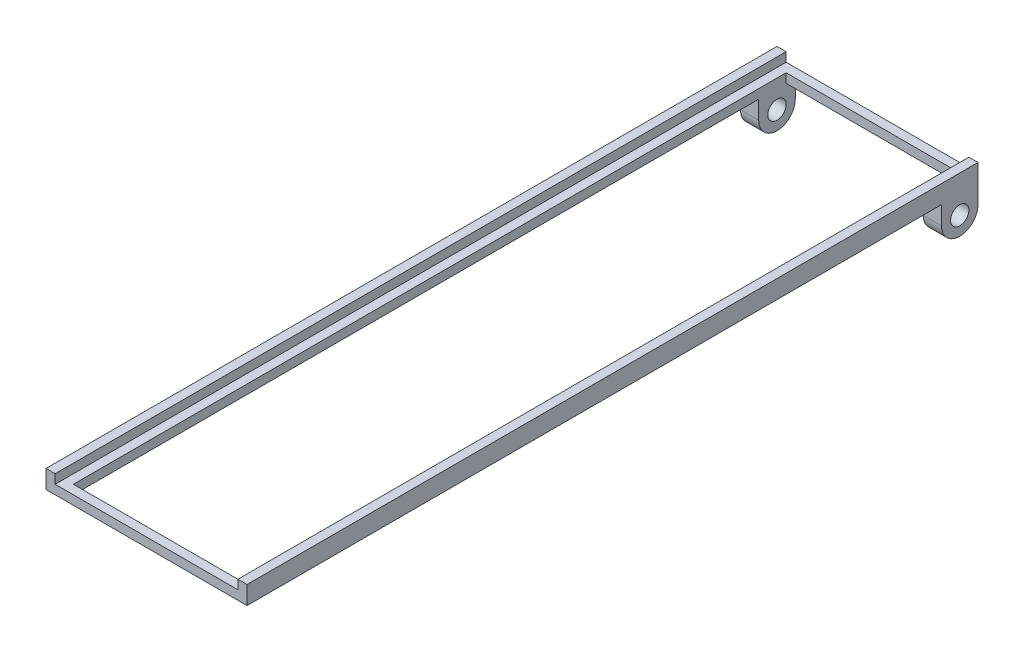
ISO-10303-21;
HEADER;
FILE_DESCRIPTION(('STEP AP214'),'2;1');
FILE_NAME('part.step','',(''),(''),'','','');
FILE_SCHEMA(('AUTOMOTIVE_DESIGN { 1 0 10303 214 1 1 1 1 }'));
ENDSEC;
DATA;
#1=APPLICATION_CONTEXT('core data for automotive mechanical design processes');
#2=APPLICATION_PROTOCOL_DEFINITION('international standard','automotive_design',2000,#1);
#3=PRODUCT_CONTEXT('',#1,'mechanical');
#4=PRODUCT('Part','Part','',(#3));
#5=PRODUCT_RELATED_PRODUCT_CATEGORY('part','',(#4));
#6=PRODUCT_DEFINITION_FORMATION('','',#4);
#7=PRODUCT_DEFINITION_CONTEXT('part definition',#1,'design');
#8=PRODUCT_DEFINITION('design','',#6,#7);
#9=PRODUCT_DEFINITION_SHAPE('','',#8);
#10=(LENGTH_UNIT() NAMED_UNIT(*) SI_UNIT(.MILLI.,.METRE.));
#11=(NAMED_UNIT(*) PLANE_ANGLE_UNIT() SI_UNIT($,.RADIAN.));
#12=(NAMED_UNIT(*) SI_UNIT($,.STERADIAN.) SOLID_ANGLE_UNIT());
#13=UNCERTAINTY_MEASURE_WITH_UNIT(LENGTH_MEASURE(1.E-05),#10,'distance_accuracy_value','');
#14=(GEOMETRIC_REPRESENTATION_CONTEXT(3) GLOBAL_UNCERTAINTY_ASSIGNED_CONTEXT((#13)) GLOBAL_UNIT_ASSIGNED_CONTEXT((#10,
#11,#12)) REPRESENTATION_CONTEXT('',''));
#15=CARTESIAN_POINT('',(0.,0.,0.));
#16=DIRECTION('',(0.,0.,1.));
#17=DIRECTION('',(1.,0.,0.));
#18=AXIS2_PLACEMENT_3D('',#15,#16,#17);
#19=CARTESIAN_POINT('',(110.,0.,800.));
#20=DIRECTION('',(0.,1.,0.));
#21=DIRECTION('',(-1.,0.,0.));
#22=AXIS2_PLACEMENT_3D('',#19,#20,#21);
#23=PLANE('',#22);
#24=DIRECTION('',(0.,0.,-1.));
#25=VECTOR('',#24,1.);
#26=CARTESIAN_POINT('',(90.,-1.2490009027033E-13,40.));
#27=LINE('',#26,#25);
#28=CARTESIAN_POINT('',(90.,-1.2490009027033E-13,10.));
#29=VERTEX_POINT('',#28);
#30=CARTESIAN_POINT('',(90.,0.,0.));
#31=VERTEX_POINT('',#30);
#32=EDGE_CURVE('E488',#29,#31,#27,.T.);
#33=ORIENTED_EDGE('',*,*,#32,.F.);
#34=DIRECTION('',(-1.,0.,0.));
#35=VECTOR('',#34,1.);
#36=CARTESIAN_POINT('',(90.,0.,9.99999999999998));
#37=LINE('',#36,#35);
#38=CARTESIAN_POINT('',(-90.,-1.2490009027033E-13,9.99999999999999));
#39=VERTEX_POINT('',#38);
#40=EDGE_CURVE('E547',#29,#39,#37,.T.);
#41=ORIENTED_EDGE('',*,*,#40,.T.);
#42=DIRECTION('',(0.,0.,-1.));
#43=VECTOR('',#42,1.);
#44=CARTESIAN_POINT('',(-90.,-1.2490009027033E-13,40.));
#45=LINE('',#44,#43);
#46=CARTESIAN_POINT('',(-90.,0.,0.));
#47=VERTEX_POINT('',#46);
#48=EDGE_CURVE('E11',#39,#47,#45,.T.);
#49=ORIENTED_EDGE('',*,*,#48,.T.);
#50=DIRECTION('',(1.,0.,0.));
#51=VECTOR('',#50,1.);
#52=CARTESIAN_POINT('',(110.,0.,0.));
#53=LINE('',#52,#51);
#54=EDGE_CURVE('E372',#47,#31,#53,.T.);
#55=ORIENTED_EDGE('',*,*,#54,.T.);
#56=EDGE_LOOP('',(#33,#41,#49,#55));
#57=FACE_BOUND('',#56,.T.);
#58=ADVANCED_FACE('F348',(#57),#23,.F.);
#59=DIRECTION('',(1.,0.,0.));
#60=VECTOR('',#59,1.);
#61=CARTESIAN_POINT('',(90.,-1.2490009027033E-13,40.));
#62=LINE('',#61,#60);
#63=CARTESIAN_POINT('',(90.,0.,40.));
#64=VERTEX_POINT('',#63);
#65=CARTESIAN_POINT('',(110.,0.,40.));
#66=VERTEX_POINT('',#65);
#67=EDGE_CURVE('E365',#64,#66,#62,.T.);
#68=ORIENTED_EDGE('',*,*,#67,.T.);
#69=DIRECTION('',(0.,0.,-1.));
#70=VECTOR('',#69,1.);
#71=CARTESIAN_POINT('',(110.,0.,800.));
#72=LINE('',#71,#70);
#73=CARTESIAN_POINT('',(110.,0.,800.));
#74=VERTEX_POINT('',#73);
#75=EDGE_CURVE('E500',#74,#66,#72,.T.);
#76=ORIENTED_EDGE('',*,*,#75,.F.);
#77=DIRECTION('',(1.,0.,0.));
#78=VECTOR('',#77,1.);
#79=CARTESIAN_POINT('',(-110.,0.,800.));
#80=LINE('',#79,#78);
#81=CARTESIAN_POINT('',(-110.,0.,800.));
#82=VERTEX_POINT('',#81);
#83=EDGE_CURVE('E603',#82,#74,#80,.T.);
#84=ORIENTED_EDGE('',*,*,#83,.F.);
#85=DIRECTION('',(0.,0.,-1.));
#86=VECTOR('',#85,1.);
#87=CARTESIAN_POINT('',(-110.,0.,800.));
#88=LINE('',#87,#86);
#89=CARTESIAN_POINT('',(-110.,-1.52655665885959E-13,40.));
#90=VERTEX_POINT('',#89);
#91=EDGE_CURVE('E532',#82,#90,#88,.T.);
#92=ORIENTED_EDGE('',*,*,#91,.T.);
#93=DIRECTION('',(-1.,0.,0.));
#94=VECTOR('',#93,1.);
#95=CARTESIAN_POINT('',(-90.,-1.2490009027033E-13,40.));
#96=LINE('',#95,#94);
#97=CARTESIAN_POINT('',(-90.,-1.2490009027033E-13,40.));
#98=VERTEX_POINT('',#97);
#99=EDGE_CURVE('E554',#98,#90,#96,.T.);
#100=ORIENTED_EDGE('',*,*,#99,.F.);
#101=DIRECTION('',(0.,0.,1.));
#102=VECTOR('',#101,1.);
#103=CARTESIAN_POINT('',(-90.,0.,790.));
#104=LINE('',#103,#102);
#105=CARTESIAN_POINT('',(-90.,0.,790.));
#106=VERTEX_POINT('',#105);
#107=EDGE_CURVE('E550',#98,#106,#104,.T.);
#108=ORIENTED_EDGE('',*,*,#107,.T.);
#109=DIRECTION('',(1.,0.,0.));
#110=VECTOR('',#109,1.);
#111=CARTESIAN_POINT('',(90.0000000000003,0.,790.));
#112=LINE('',#111,#110);
#113=CARTESIAN_POINT('',(90.0000000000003,0.,790.));
#114=VERTEX_POINT('',#113);
#115=EDGE_CURVE('E577',#106,#114,#112,.T.);
#116=ORIENTED_EDGE('',*,*,#115,.T.);
#117=DIRECTION('',(0.,0.,-1.));
#118=VECTOR('',#117,1.);
#119=CARTESIAN_POINT('',(90.0000000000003,0.,790.));
#120=LINE('',#119,#118);
#121=EDGE_CURVE('E544',#114,#64,#120,.T.);
#122=ORIENTED_EDGE('',*,*,#121,.T.);
#123=EDGE_LOOP('',(#68,#76,#84,#92,#100,#108,#116,#122));
#124=FACE_BOUND('',#123,.T.);
#125=ADVANCED_FACE('F675',(#124),#23,.F.);
#126=CARTESIAN_POINT('',(100.,10.,800.));
#127=DIRECTION('',(1.,0.,0.));
#128=DIRECTION('',(0.,0.,-1.));
#129=AXIS2_PLACEMENT_3D('',#126,#127,#128);
#130=PLANE('',#129);
#131=DIRECTION('',(0.,-1.,0.));
#132=VECTOR('',#131,1.);
#133=CARTESIAN_POINT('',(100.,10.,0.));
#134=LINE('',#133,#132);
#135=CARTESIAN_POINT('',(100.,20.,0.));
#136=VERTEX_POINT('',#135);
#137=CARTESIAN_POINT('',(100.,10.,0.));
#138=VERTEX_POINT('',#137);
#139=EDGE_CURVE('E637',#136,#138,#134,.T.);
#140=ORIENTED_EDGE('',*,*,#139,.T.);
#141=DIRECTION('',(0.,0.,-1.));
#142=VECTOR('',#141,1.);
#143=CARTESIAN_POINT('',(100.,10.,800.));
#144=LINE('',#143,#142);
#145=CARTESIAN_POINT('',(100.,10.,800.));
#146=VERTEX_POINT('',#145);
#147=EDGE_CURVE('E357',#146,#138,#144,.T.);
#148=ORIENTED_EDGE('',*,*,#147,.F.);
#149=DIRECTION('',(0.,-1.,0.));
#150=VECTOR('',#149,1.);
#151=CARTESIAN_POINT('',(100.,10.,800.));
#152=LINE('',#151,#150);
#153=CARTESIAN_POINT('',(100.,20.,800.));
#154=VERTEX_POINT('',#153);
#155=EDGE_CURVE('E592',#154,#146,#152,.T.);
#156=ORIENTED_EDGE('',*,*,#155,.F.);
#157=DIRECTION('',(0.,0.,-1.));
#158=VECTOR('',#157,1.);
#159=CARTESIAN_POINT('',(100.,20.,800.));
#160=LINE('',#159,#158);
#161=EDGE_CURVE('E609',#154,#136,#160,.T.);
#162=ORIENTED_EDGE('',*,*,#161,.T.);
#163=EDGE_LOOP('',(#140,#148,#156,#162));
#164=FACE_BOUND('',#163,.T.);
#165=ADVANCED_FACE('F350',(#164),#130,.F.);
#166=CARTESIAN_POINT('',(50.,10.,800.));
#167=DIRECTION('',(0.,-1.,0.));
#168=DIRECTION('',(1.,0.,0.));
#169=AXIS2_PLACEMENT_3D('',#166,#167,#168);
#170=PLANE('',#169);
#171=DIRECTION('',(0.,0.,1.));
#172=VECTOR('',#171,1.);
#173=CARTESIAN_POINT('',(-90.,10.,790.));
#174=LINE('',#173,#172);
#175=CARTESIAN_POINT('',(-90.,9.99999999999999,10.));
#176=VERTEX_POINT('',#175);
#177=CARTESIAN_POINT('',(-90.,10.,790.));
#178=VERTEX_POINT('',#177);
#179=EDGE_CURVE('E567',#176,#178,#174,.T.);
#180=ORIENTED_EDGE('',*,*,#179,.F.);
#181=DIRECTION('',(-1.,0.,0.));
#182=VECTOR('',#181,1.);
#183=CARTESIAN_POINT('',(90.,10.,9.99999999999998));
#184=LINE('',#183,#182);
#185=CARTESIAN_POINT('',(90.,10.,9.99999999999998));
#186=VERTEX_POINT('',#185);
#187=EDGE_CURVE('E556',#186,#176,#184,.T.);
#188=ORIENTED_EDGE('',*,*,#187,.F.);
#189=DIRECTION('',(0.,0.,-1.));
#190=VECTOR('',#189,1.);
#191=CARTESIAN_POINT('',(90.0000000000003,10.,790.));
#192=LINE('',#191,#190);
#193=CARTESIAN_POINT('',(90.0000000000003,10.,790.));
#194=VERTEX_POINT('',#193);
#195=EDGE_CURVE('E551',#194,#186,#192,.T.);
#196=ORIENTED_EDGE('',*,*,#195,.F.);
#197=DIRECTION('',(1.,0.,0.));
#198=VECTOR('',#197,1.);
#199=CARTESIAN_POINT('',(90.0000000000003,10.,790.));
#200=LINE('',#199,#198);
#201=EDGE_CURVE('E570',#178,#194,#200,.T.);
#202=ORIENTED_EDGE('',*,*,#201,.F.);
#203=EDGE_LOOP('',(#180,#188,#196,#202));
#204=FACE_BOUND('',#203,.T.);
#205=DIRECTION('',(-1.,0.,0.));
#206=VECTOR('',#205,1.);
#207=CARTESIAN_POINT('',(50.,10.,0.));
#208=LINE('',#207,#206);
#209=CARTESIAN_POINT('',(-100.,9.99999999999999,0.));
#210=VERTEX_POINT('',#209);
#211=EDGE_CURVE('E633',#138,#210,#208,.T.);
#212=ORIENTED_EDGE('',*,*,#211,.T.);
#213=DIRECTION('',(0.,0.,-1.));
#214=VECTOR('',#213,1.);
#215=CARTESIAN_POINT('',(-100.,9.99999999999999,800.));
#216=LINE('',#215,#214);
#217=CARTESIAN_POINT('',(-100.,9.99999999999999,800.));
#218=VERTEX_POINT('',#217);
#219=EDGE_CURVE('E622',#218,#210,#216,.T.);
#220=ORIENTED_EDGE('',*,*,#219,.F.);
#221=DIRECTION('',(-1.,0.,0.));
#222=VECTOR('',#221,1.);
#223=CARTESIAN_POINT('',(50.,10.,800.));
#224=LINE('',#223,#222);
#225=EDGE_CURVE('E595',#146,#218,#224,.T.);
#226=ORIENTED_EDGE('',*,*,#225,.F.);
#227=ORIENTED_EDGE('',*,*,#147,.T.);
#228=EDGE_LOOP('',(#212,#220,#226,#227));
#229=FACE_BOUND('',#228,.T.);
#230=ADVANCED_FACE('F632',(#204,#229),#170,.F.);
#231=CARTESIAN_POINT('',(-100.,9.99999999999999,800.));
#232=DIRECTION('',(-1.,0.,0.));
#233=DIRECTION('',(0.,-1.,0.));
#234=AXIS2_PLACEMENT_3D('',#231,#232,#233);
#235=PLANE('',#234);
#236=DIRECTION('',(0.,1.,0.));
#237=VECTOR('',#236,1.);
#238=CARTESIAN_POINT('',(-100.,9.99999999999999,0.));
#239=LINE('',#238,#237);
#240=CARTESIAN_POINT('',(-100.,20.,0.));
#241=VERTEX_POINT('',#240);
#242=EDGE_CURVE('E643',#210,#241,#239,.T.);
#243=ORIENTED_EDGE('',*,*,#242,.T.);
#244=DIRECTION('',(0.,0.,-1.));
#245=VECTOR('',#244,1.);
#246=CARTESIAN_POINT('',(-100.,20.,800.));
#247=LINE('',#246,#245);
#248=CARTESIAN_POINT('',(-100.,20.,800.));
#249=VERTEX_POINT('',#248);
#250=EDGE_CURVE('E620',#249,#241,#247,.T.);
#251=ORIENTED_EDGE('',*,*,#250,.F.);
#252=DIRECTION('',(0.,1.,0.));
#253=VECTOR('',#252,1.);
#254=CARTESIAN_POINT('',(-100.,9.99999999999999,800.));
#255=LINE('',#254,#253);
#256=EDGE_CURVE('E597',#218,#249,#255,.T.);
#257=ORIENTED_EDGE('',*,*,#256,.F.);
#258=ORIENTED_EDGE('',*,*,#219,.T.);
#259=EDGE_LOOP('',(#243,#251,#257,#258));
#260=FACE_BOUND('',#259,.T.);
#261=ADVANCED_FACE('F684',(#260),#235,.F.);
#262=CARTESIAN_POINT('',(-100.,20.,800.));
#263=DIRECTION('',(0.,-1.,0.));
#264=DIRECTION('',(1.,0.,0.));
#265=AXIS2_PLACEMENT_3D('',#262,#263,#264);
#266=PLANE('',#265);
#267=DIRECTION('',(-1.,0.,0.));
#268=VECTOR('',#267,1.);
#269=CARTESIAN_POINT('',(-100.,20.,0.));
#270=LINE('',#269,#268);
#271=CARTESIAN_POINT('',(-110.,20.,0.));
#272=VERTEX_POINT('',#271);
#273=EDGE_CURVE('E650',#241,#272,#270,.T.);
#274=ORIENTED_EDGE('',*,*,#273,.T.);
#275=DIRECTION('',(0.,0.,-1.));
#276=VECTOR('',#275,1.);
#277=CARTESIAN_POINT('',(-110.,20.,800.));
#278=LINE('',#277,#276);
#279=CARTESIAN_POINT('',(-110.,20.,800.));
#280=VERTEX_POINT('',#279);
#281=EDGE_CURVE('E617',#280,#272,#278,.T.);
#282=ORIENTED_EDGE('',*,*,#281,.F.);
#283=DIRECTION('',(-1.,0.,0.));
#284=VECTOR('',#283,1.);
#285=CARTESIAN_POINT('',(-100.,20.,800.));
#286=LINE('',#285,#284);
#287=EDGE_CURVE('E599',#249,#280,#286,.T.);
#288=ORIENTED_EDGE('',*,*,#287,.F.);
#289=ORIENTED_EDGE('',*,*,#250,.T.);
#290=EDGE_LOOP('',(#274,#282,#288,#289));
#291=FACE_BOUND('',#290,.T.);
#292=ADVANCED_FACE('F682',(#291),#266,.F.);
#293=CARTESIAN_POINT('',(-110.,20.,800.));
#294=DIRECTION('',(1.,0.,0.));
#295=DIRECTION('',(0.,1.,0.));
#296=AXIS2_PLACEMENT_3D('',#293,#294,#295);
#297=PLANE('',#296);
#298=DIRECTION('',(0.,-1.,0.));
#299=VECTOR('',#298,1.);
#300=CARTESIAN_POINT('',(-110.,20.,0.));
#301=LINE('',#300,#299);
#302=CARTESIAN_POINT('',(-110.,-20.0000000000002,0.));
#303=VERTEX_POINT('',#302);
#304=EDGE_CURVE('E584',#272,#303,#301,.T.);
#305=ORIENTED_EDGE('',*,*,#304,.T.);
#306=CARTESIAN_POINT('',(-110.,-20.0000000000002,20.));
#307=DIRECTION('',(-1.,0.,0.));
#308=DIRECTION('',(0.,-1.,0.));
#309=AXIS2_PLACEMENT_3D('',#306,#307,#308);
#310=CIRCLE('',#309,20.);
#311=CARTESIAN_POINT('',(-110.,-20.0000000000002,40.));
#312=VERTEX_POINT('',#311);
#313=EDGE_CURVE('E522',#303,#312,#310,.T.);
#314=ORIENTED_EDGE('',*,*,#313,.T.);
#315=DIRECTION('',(0.,1.,0.));
#316=VECTOR('',#315,1.);
#317=CARTESIAN_POINT('',(-110.,-1.52655665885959E-13,40.));
#318=LINE('',#317,#316);
#319=EDGE_CURVE('E525',#312,#90,#318,.T.);
#320=ORIENTED_EDGE('',*,*,#319,.T.);
#321=ORIENTED_EDGE('',*,*,#91,.F.);
#322=DIRECTION('',(0.,-1.,0.));
#323=VECTOR('',#322,1.);
#324=CARTESIAN_POINT('',(-110.,20.,800.));
#325=LINE('',#324,#323);
#326=EDGE_CURVE('E601',#280,#82,#325,.T.);
#327=ORIENTED_EDGE('',*,*,#326,.F.);
#328=ORIENTED_EDGE('',*,*,#281,.T.);
#329=EDGE_LOOP('',(#305,#314,#320,#321,#327,#328));
#330=FACE_BOUND('',#329,.T.);
#331=CARTESIAN_POINT('',(-110.,-20.0000000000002,20.));
#332=DIRECTION('',(-1.,0.,0.));
#333=DIRECTION('',(0.,-1.,0.));
#334=AXIS2_PLACEMENT_3D('',#331,#332,#333);
#335=CIRCLE('',#334,10.);
#336=CARTESIAN_POINT('',(-110.,-30.0000000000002,20.));
#337=VERTEX_POINT('',#336);
#338=EDGE_CURVE('E514',#337,#337,#335,.T.);
#339=ORIENTED_EDGE('',*,*,#338,.F.);
#340=EDGE_LOOP('',(#339));
#341=FACE_BOUND('',#340,.T.);
#342=ADVANCED_FACE('F656',(#330,#341),#297,.F.);
#343=CARTESIAN_POINT('',(110.,20.,800.));
#344=DIRECTION('',(-1.,0.,0.));
#345=DIRECTION('',(0.,0.,1.));
#346=AXIS2_PLACEMENT_3D('',#343,#344,#345);
#347=PLANE('',#346);
#348=DIRECTION('',(0.,1.,0.));
#349=VECTOR('',#348,1.);
#350=CARTESIAN_POINT('',(110.,20.,0.));
#351=LINE('',#350,#349);
#352=CARTESIAN_POINT('',(110.,-20.0000000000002,0.));
#353=VERTEX_POINT('',#352);
#354=CARTESIAN_POINT('',(110.,20.,0.));
#355=VERTEX_POINT('',#354);
#356=EDGE_CURVE('E583',#353,#355,#351,.T.);
#357=ORIENTED_EDGE('',*,*,#356,.T.);
#358=DIRECTION('',(0.,0.,-1.));
#359=VECTOR('',#358,1.);
#360=CARTESIAN_POINT('',(110.,20.,800.));
#361=LINE('',#360,#359);
#362=CARTESIAN_POINT('',(110.,20.,800.));
#363=VERTEX_POINT('',#362);
#364=EDGE_CURVE('E612',#363,#355,#361,.T.);
#365=ORIENTED_EDGE('',*,*,#364,.F.);
#366=DIRECTION('',(0.,1.,0.));
#367=VECTOR('',#366,1.);
#368=CARTESIAN_POINT('',(110.,20.,800.));
#369=LINE('',#368,#367);
#370=EDGE_CURVE('E605',#74,#363,#369,.T.);
#371=ORIENTED_EDGE('',*,*,#370,.F.);
#372=ORIENTED_EDGE('',*,*,#75,.T.);
#373=DIRECTION('',(0.,1.,0.));
#374=VECTOR('',#373,1.);
#375=CARTESIAN_POINT('',(110.,-1.52655665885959E-13,40.));
#376=LINE('',#375,#374);
#377=CARTESIAN_POINT('',(110.,-20.0000000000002,40.));
#378=VERTEX_POINT('',#377);
#379=EDGE_CURVE('E489',#378,#66,#376,.T.);
#380=ORIENTED_EDGE('',*,*,#379,.F.);
#381=CARTESIAN_POINT('',(110.,-20.0000000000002,20.));
#382=DIRECTION('',(-1.,0.,0.));
#383=DIRECTION('',(0.,-1.,0.));
#384=AXIS2_PLACEMENT_3D('',#381,#382,#383);
#385=CIRCLE('',#384,20.);
#386=EDGE_CURVE('E478',#353,#378,#385,.T.);
#387=ORIENTED_EDGE('',*,*,#386,.F.);
#388=EDGE_LOOP('',(#357,#365,#371,#372,#380,#387));
#389=FACE_BOUND('',#388,.T.);
#390=CARTESIAN_POINT('',(110.,-20.0000000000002,20.));
#391=DIRECTION('',(-1.,0.,0.));
#392=DIRECTION('',(0.,-1.,0.));
#393=AXIS2_PLACEMENT_3D('',#390,#391,#392);
#394=CIRCLE('',#393,10.);
#395=CARTESIAN_POINT('',(110.,-30.0000000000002,20.));
#396=VERTEX_POINT('',#395);
#397=EDGE_CURVE('E504',#396,#396,#394,.T.);
#398=ORIENTED_EDGE('',*,*,#397,.T.);
#399=EDGE_LOOP('',(#398));
#400=FACE_BOUND('',#399,.T.);
#401=ADVANCED_FACE('F497',(#389,#400),#347,.F.);
#402=CARTESIAN_POINT('',(100.,20.,800.));
#403=DIRECTION('',(0.,-1.,0.));
#404=DIRECTION('',(0.,0.,-1.));
#405=AXIS2_PLACEMENT_3D('',#402,#403,#404);
#406=PLANE('',#405);
#407=DIRECTION('',(-1.,0.,0.));
#408=VECTOR('',#407,1.);
#409=CARTESIAN_POINT('',(100.,20.,0.));
#410=LINE('',#409,#408);
#411=EDGE_CURVE('E590',#355,#136,#410,.T.);
#412=ORIENTED_EDGE('',*,*,#411,.T.);
#413=ORIENTED_EDGE('',*,*,#161,.F.);
#414=DIRECTION('',(-1.,0.,0.));
#415=VECTOR('',#414,1.);
#416=CARTESIAN_POINT('',(100.,20.,800.));
#417=LINE('',#416,#415);
#418=EDGE_CURVE('E607',#363,#154,#417,.T.);
#419=ORIENTED_EDGE('',*,*,#418,.F.);
#420=ORIENTED_EDGE('',*,*,#364,.T.);
#421=EDGE_LOOP('',(#412,#413,#419,#420));
#422=FACE_BOUND('',#421,.T.);
#423=ADVANCED_FACE('F700',(#422),#406,.F.);
#424=CARTESIAN_POINT('',(100.,20.,800.));
#425=DIRECTION('',(0.,0.,-1.));
#426=DIRECTION('',(-1.,0.,0.));
#427=AXIS2_PLACEMENT_3D('',#424,#425,#426);
#428=PLANE('',#427);
#429=ORIENTED_EDGE('',*,*,#155,.T.);
#430=ORIENTED_EDGE('',*,*,#225,.T.);
#431=ORIENTED_EDGE('',*,*,#256,.T.);
#432=ORIENTED_EDGE('',*,*,#287,.T.);
#433=ORIENTED_EDGE('',*,*,#326,.T.);
#434=ORIENTED_EDGE('',*,*,#83,.T.);
#435=ORIENTED_EDGE('',*,*,#370,.T.);
#436=ORIENTED_EDGE('',*,*,#418,.T.);
#437=EDGE_LOOP('',(#429,#430,#431,#432,#433,#434,#435,#436));
#438=FACE_BOUND('',#437,.T.);
#439=ADVANCED_FACE('F678',(#438),#428,.F.);
#440=CARTESIAN_POINT('',(100.,20.,0.));
#441=DIRECTION('',(0.,0.,-1.));
#442=DIRECTION('',(-1.,0.,0.));
#443=AXIS2_PLACEMENT_3D('',#440,#441,#442);
#444=PLANE('',#443);
#445=ORIENTED_EDGE('',*,*,#139,.F.);
#446=ORIENTED_EDGE('',*,*,#411,.F.);
#447=ORIENTED_EDGE('',*,*,#356,.F.);
#448=DIRECTION('',(1.,0.,0.));
#449=VECTOR('',#448,1.);
#450=CARTESIAN_POINT('',(89.9999999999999,-20.0000000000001,0.));
#451=LINE('',#450,#449);
#452=CARTESIAN_POINT('',(89.9999999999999,-20.0000000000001,0.));
#453=VERTEX_POINT('',#452);
#454=EDGE_CURVE('E485',#453,#353,#451,.T.);
#455=ORIENTED_EDGE('',*,*,#454,.F.);
#456=DIRECTION('',(0.,-1.,0.));
#457=VECTOR('',#456,1.);
#458=CARTESIAN_POINT('',(90.,-1.2490009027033E-13,0.));
#459=LINE('',#458,#457);
#460=EDGE_CURVE('E512',#31,#453,#459,.T.);
#461=ORIENTED_EDGE('',*,*,#460,.F.);
#462=ORIENTED_EDGE('',*,*,#54,.F.);
#463=DIRECTION('',(0.,-1.,0.));
#464=VECTOR('',#463,1.);
#465=CARTESIAN_POINT('',(-90.,-1.2490009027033E-13,0.));
#466=LINE('',#465,#464);
#467=CARTESIAN_POINT('',(-89.9999999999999,-20.0000000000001,0.));
#468=VERTEX_POINT('',#467);
#469=EDGE_CURVE('E535',#47,#468,#466,.T.);
#470=ORIENTED_EDGE('',*,*,#469,.T.);
#471=DIRECTION('',(-1.,0.,0.));
#472=VECTOR('',#471,1.);
#473=CARTESIAN_POINT('',(-89.9999999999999,-20.0000000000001,0.));
#474=LINE('',#473,#472);
#475=EDGE_CURVE('E563',#468,#303,#474,.T.);
#476=ORIENTED_EDGE('',*,*,#475,.T.);
#477=ORIENTED_EDGE('',*,*,#304,.F.);
#478=ORIENTED_EDGE('',*,*,#273,.F.);
#479=ORIENTED_EDGE('',*,*,#242,.F.);
#480=ORIENTED_EDGE('',*,*,#211,.F.);
#481=EDGE_LOOP('',(#445,#446,#447,#455,#461,#462,#470,#476,#477,#478,#479,#480));
#482=FACE_BOUND('',#481,.T.);
#483=ADVANCED_FACE('F662',(#482),#444,.T.);
#484=CARTESIAN_POINT('',(90.,0.,9.99999999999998));
#485=DIRECTION('',(0.,0.,-1.));
#486=DIRECTION('',(-1.,0.,0.));
#487=AXIS2_PLACEMENT_3D('',#484,#485,#486);
#488=PLANE('',#487);
#489=ORIENTED_EDGE('',*,*,#187,.T.);
#490=DIRECTION('',(0.,1.,0.));
#491=VECTOR('',#490,1.);
#492=CARTESIAN_POINT('',(-90.,0.,10.));
#493=LINE('',#492,#491);
#494=EDGE_CURVE('E540',#39,#176,#493,.T.);
#495=ORIENTED_EDGE('',*,*,#494,.F.);
#496=ORIENTED_EDGE('',*,*,#40,.F.);
#497=DIRECTION('',(0.,1.,0.));
#498=VECTOR('',#497,1.);
#499=CARTESIAN_POINT('',(90.,0.,9.99999999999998));
#500=LINE('',#499,#498);
#501=EDGE_CURVE('E641',#29,#186,#500,.T.);
#502=ORIENTED_EDGE('',*,*,#501,.T.);
#503=EDGE_LOOP('',(#489,#495,#496,#502));
#504=FACE_BOUND('',#503,.T.);
#505=ADVANCED_FACE('F708',(#504),#488,.F.);
#506=CARTESIAN_POINT('',(90.0000000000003,0.,790.));
#507=DIRECTION('',(1.,0.,0.));
#508=DIRECTION('',(0.,0.,-1.));
#509=AXIS2_PLACEMENT_3D('',#506,#507,#508);
#510=PLANE('',#509);
#511=ORIENTED_EDGE('',*,*,#195,.T.);
#512=ORIENTED_EDGE('',*,*,#501,.F.);
#513=ORIENTED_EDGE('',*,*,#32,.T.);
#514=ORIENTED_EDGE('',*,*,#460,.T.);
#515=CARTESIAN_POINT('',(89.9999999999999,-20.0000000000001,20.));
#516=DIRECTION('',(-1.,0.,0.));
#517=DIRECTION('',(0.,-1.,0.));
#518=AXIS2_PLACEMENT_3D('',#515,#516,#517);
#519=CIRCLE('',#518,20.);
#520=CARTESIAN_POINT('',(89.9999999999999,-20.0000000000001,40.));
#521=VERTEX_POINT('',#520);
#522=EDGE_CURVE('E510',#453,#521,#519,.T.);
#523=ORIENTED_EDGE('',*,*,#522,.T.);
#524=DIRECTION('',(0.,1.,0.));
#525=VECTOR('',#524,1.);
#526=CARTESIAN_POINT('',(90.,-1.2490009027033E-13,40.));
#527=LINE('',#526,#525);
#528=EDGE_CURVE('E495',#521,#64,#527,.T.);
#529=ORIENTED_EDGE('',*,*,#528,.T.);
#530=ORIENTED_EDGE('',*,*,#121,.F.);
#531=DIRECTION('',(0.,1.,0.));
#532=VECTOR('',#531,1.);
#533=CARTESIAN_POINT('',(90.0000000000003,0.,790.));
#534=LINE('',#533,#532);
#535=EDGE_CURVE('E645',#114,#194,#534,.T.);
#536=ORIENTED_EDGE('',*,*,#535,.T.);
#537=EDGE_LOOP('',(#511,#512,#513,#514,#523,#529,#530,#536));
#538=FACE_BOUND('',#537,.T.);
#539=CARTESIAN_POINT('',(89.9999999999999,-20.0000000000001,20.));
#540=DIRECTION('',(-1.,0.,0.));
#541=DIRECTION('',(0.,-1.,0.));
#542=AXIS2_PLACEMENT_3D('',#539,#540,#541);
#543=CIRCLE('',#542,10.);
#544=CARTESIAN_POINT('',(89.9999999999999,-30.0000000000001,20.));
#545=VERTEX_POINT('',#544);
#546=EDGE_CURVE('E501',#545,#545,#543,.T.);
#547=ORIENTED_EDGE('',*,*,#546,.F.);
#548=EDGE_LOOP('',(#547));
#549=FACE_BOUND('',#548,.T.);
#550=ADVANCED_FACE('F711',(#538,#549),#510,.F.);
#551=CARTESIAN_POINT('',(90.0000000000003,0.,790.));
#552=DIRECTION('',(0.,0.,1.));
#553=DIRECTION('',(1.,0.,0.));
#554=AXIS2_PLACEMENT_3D('',#551,#552,#553);
#555=PLANE('',#554);
#556=ORIENTED_EDGE('',*,*,#201,.T.);
#557=ORIENTED_EDGE('',*,*,#535,.F.);
#558=ORIENTED_EDGE('',*,*,#115,.F.);
#559=DIRECTION('',(0.,1.,0.));
#560=VECTOR('',#559,1.);
#561=CARTESIAN_POINT('',(-90.,0.,790.));
#562=LINE('',#561,#560);
#563=EDGE_CURVE('E543',#106,#178,#562,.T.);
#564=ORIENTED_EDGE('',*,*,#563,.T.);
#565=EDGE_LOOP('',(#556,#557,#558,#564));
#566=FACE_BOUND('',#565,.T.);
#567=ADVANCED_FACE('F716',(#566),#555,.F.);
#568=CARTESIAN_POINT('',(-90.,0.,790.));
#569=DIRECTION('',(-1.,0.,0.));
#570=DIRECTION('',(0.,0.,1.));
#571=AXIS2_PLACEMENT_3D('',#568,#569,#570);
#572=PLANE('',#571);
#573=ORIENTED_EDGE('',*,*,#179,.T.);
#574=ORIENTED_EDGE('',*,*,#563,.F.);
#575=ORIENTED_EDGE('',*,*,#107,.F.);
#576=DIRECTION('',(0.,1.,0.));
#577=VECTOR('',#576,1.);
#578=CARTESIAN_POINT('',(-90.,-1.2490009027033E-13,40.));
#579=LINE('',#578,#577);
#580=CARTESIAN_POINT('',(-89.9999999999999,-20.0000000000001,40.));
#581=VERTEX_POINT('',#580);
#582=EDGE_CURVE('E558',#581,#98,#579,.T.);
#583=ORIENTED_EDGE('',*,*,#582,.F.);
#584=CARTESIAN_POINT('',(-89.9999999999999,-20.0000000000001,20.));
#585=DIRECTION('',(-1.,0.,0.));
#586=DIRECTION('',(0.,-1.,0.));
#587=AXIS2_PLACEMENT_3D('',#584,#585,#586);
#588=CIRCLE('',#587,20.);
#589=EDGE_CURVE('E528',#468,#581,#588,.T.);
#590=ORIENTED_EDGE('',*,*,#589,.F.);
#591=ORIENTED_EDGE('',*,*,#469,.F.);
#592=ORIENTED_EDGE('',*,*,#48,.F.);
#593=ORIENTED_EDGE('',*,*,#494,.T.);
#594=EDGE_LOOP('',(#573,#574,#575,#583,#590,#591,#592,#593));
#595=FACE_BOUND('',#594,.T.);
#596=CARTESIAN_POINT('',(-89.9999999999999,-20.0000000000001,20.));
#597=DIRECTION('',(-1.,0.,0.));
#598=DIRECTION('',(0.,-1.,0.));
#599=AXIS2_PLACEMENT_3D('',#596,#597,#598);
#600=CIRCLE('',#599,10.);
#601=CARTESIAN_POINT('',(-89.9999999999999,-30.0000000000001,20.));
#602=VERTEX_POINT('',#601);
#603=EDGE_CURVE('E519',#602,#602,#600,.T.);
#604=ORIENTED_EDGE('',*,*,#603,.T.);
#605=EDGE_LOOP('',(#604));
#606=FACE_BOUND('',#605,.T.);
#607=ADVANCED_FACE('F713',(#595,#606),#572,.F.);
#608=CARTESIAN_POINT('',(-90.,-1.2490009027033E-13,40.));
#609=DIRECTION('',(0.,0.,1.));
#610=DIRECTION('',(1.,0.,0.));
#611=AXIS2_PLACEMENT_3D('',#608,#609,#610);
#612=PLANE('',#611);
#613=ORIENTED_EDGE('',*,*,#319,.F.);
#614=DIRECTION('',(-1.,0.,0.));
#615=VECTOR('',#614,1.);
#616=CARTESIAN_POINT('',(-89.9999999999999,-20.0000000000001,40.));
#617=LINE('',#616,#615);
#618=EDGE_CURVE('E557',#581,#312,#617,.T.);
#619=ORIENTED_EDGE('',*,*,#618,.F.);
#620=ORIENTED_EDGE('',*,*,#582,.T.);
#621=ORIENTED_EDGE('',*,*,#99,.T.);
#622=EDGE_LOOP('',(#613,#619,#620,#621));
#623=FACE_BOUND('',#622,.T.);
#624=ADVANCED_FACE('F669',(#623),#612,.T.);
#625=CARTESIAN_POINT('',(-89.9999999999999,-20.0000000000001,20.));
#626=DIRECTION('',(-1.,0.,0.));
#627=DIRECTION('',(0.,-1.,0.));
#628=AXIS2_PLACEMENT_3D('',#625,#626,#627);
#629=CYLINDRICAL_SURFACE('',#628,20.);
#630=ORIENTED_EDGE('',*,*,#313,.F.);
#631=ORIENTED_EDGE('',*,*,#475,.F.);
#632=ORIENTED_EDGE('',*,*,#589,.T.);
#633=ORIENTED_EDGE('',*,*,#618,.T.);
#634=EDGE_LOOP('',(#630,#631,#632,#633));
#635=FACE_BOUND('',#634,.T.);
#636=ADVANCED_FACE('F666',(#635),#629,.T.);
#637=CARTESIAN_POINT('',(-89.9999999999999,-20.0000000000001,20.));
#638=DIRECTION('',(-1.,0.,0.));
#639=DIRECTION('',(0.,-1.,0.));
#640=AXIS2_PLACEMENT_3D('',#637,#638,#639);
#641=CYLINDRICAL_SURFACE('',#640,10.);
#642=ORIENTED_EDGE('',*,*,#603,.F.);
#643=EDGE_LOOP('',(#642));
#644=FACE_BOUND('',#643,.T.);
#645=ORIENTED_EDGE('',*,*,#338,.T.);
#646=EDGE_LOOP('',(#645));
#647=FACE_BOUND('',#646,.T.);
#648=ADVANCED_FACE('F726',(#644,#647),#641,.F.);
#649=CARTESIAN_POINT('',(89.9999999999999,-20.0000000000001,20.));
#650=DIRECTION('',(1.,0.,0.));
#651=DIRECTION('',(0.,1.,0.));
#652=AXIS2_PLACEMENT_3D('',#649,#650,#651);
#653=CYLINDRICAL_SURFACE('',#652,20.);
#654=ORIENTED_EDGE('',*,*,#386,.T.);
#655=DIRECTION('',(1.,0.,0.));
#656=VECTOR('',#655,1.);
#657=CARTESIAN_POINT('',(89.9999999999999,-20.0000000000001,40.));
#658=LINE('',#657,#656);
#659=EDGE_CURVE('E482',#521,#378,#658,.T.);
#660=ORIENTED_EDGE('',*,*,#659,.F.);
#661=ORIENTED_EDGE('',*,*,#522,.F.);
#662=ORIENTED_EDGE('',*,*,#454,.T.);
#663=EDGE_LOOP('',(#654,#660,#661,#662));
#664=FACE_BOUND('',#663,.T.);
#665=ADVANCED_FACE('F480',(#664),#653,.T.);
#666=CARTESIAN_POINT('',(90.,-1.2490009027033E-13,40.));
#667=DIRECTION('',(0.,0.,-1.));
#668=DIRECTION('',(-1.,0.,0.));
#669=AXIS2_PLACEMENT_3D('',#666,#667,#668);
#670=PLANE('',#669);
#671=ORIENTED_EDGE('',*,*,#379,.T.);
#672=ORIENTED_EDGE('',*,*,#67,.F.);
#673=ORIENTED_EDGE('',*,*,#528,.F.);
#674=ORIENTED_EDGE('',*,*,#659,.T.);
#675=EDGE_LOOP('',(#671,#672,#673,#674));
#676=FACE_BOUND('',#675,.T.);
#677=ADVANCED_FACE('F493',(#676),#670,.F.);
#678=CARTESIAN_POINT('',(89.9999999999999,-20.0000000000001,20.));
#679=DIRECTION('',(1.,0.,0.));
#680=DIRECTION('',(0.,1.,0.));
#681=AXIS2_PLACEMENT_3D('',#678,#679,#680);
#682=CYLINDRICAL_SURFACE('',#681,10.);
#683=ORIENTED_EDGE('',*,*,#546,.T.);
#684=EDGE_LOOP('',(#683));
#685=FACE_BOUND('',#684,.T.);
#686=ORIENTED_EDGE('',*,*,#397,.F.);
#687=EDGE_LOOP('',(#686));
#688=FACE_BOUND('',#687,.T.);
#689=ADVANCED_FACE('F734',(#685,#688),#682,.F.);
#690=CLOSED_SHELL('',(#58,#125,#165,#230,#261,#292,#342,#401,#423,#439,#483,#505,#550,#567,#607,
#624,#636,#648,#665,#677,#689));
#691=MANIFOLD_SOLID_BREP('B2',#690);
#692=ADVANCED_BREP_SHAPE_REPRESENTATION('',(#18,#691),#14);
#693=SHAPE_DEFINITION_REPRESENTATION(#9,#692);
ENDSEC;
END-ISO-10303-21;
